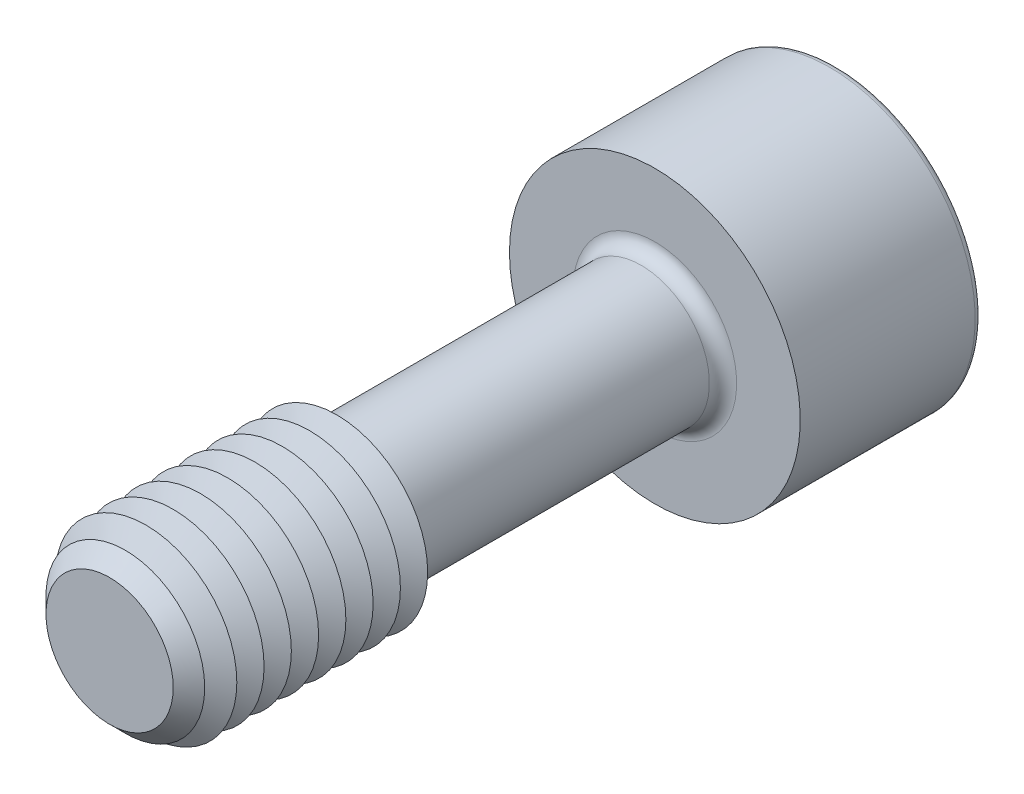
from build123d import *

# Parameters (mm, degrees)
SKETCH1_R       = 3.75
EXTRUDE1_DEPTH  = 15
CHAMFER1_SIZE   = 1.5
SKETCH3_R       = 8
EXTRUDE2_DEPTH  = 10
EXTRUDE3_DEPTH  = 8
FILLET1_R       = 0.75
FILLET2_R       = 0.375
LPATTERN1_COUNT = 8
LPATTERN1_PITCH = 1.5


with BuildPart() as part:
    # Sketch1 → Extrude1 (new, symmetric)
    with BuildSketch(Plane.XY):
        Circle(SKETCH1_R)
    extrude(amount=EXTRUDE1_DEPTH, both=True)

    # Sketch2 → Revolve1 (revolve)
    with BuildSketch(Plane(origin=(0, 0, 0), x_dir=(0, 0, -1), z_dir=(1, 0, 0))):
        Polygon((-15, 0), (-15, 5), (-2.5, 5), (-1.778312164, 3.75), (-1.778312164, 0), align=None)
    revolve(axis=Axis((0, 0, 1.778312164), (0, 0, 1)))

    # Chamfer1
    chamfer1_edges = [part.edges().sort_by_distance(p)[0] for p in [
        (0, -5, 15),
    ]]
    chamfer(chamfer1_edges, length=CHAMFER1_SIZE)

    # Sketch3 → Extrude2 (add)
    with BuildSketch(Plane(origin=(0, 0, -15), x_dir=(-1, 0, 0), z_dir=(0, 0, -1))):
        Circle(SKETCH3_R)
    extrude(amount=EXTRUDE2_DEPTH)

    # Sketch4 → Extrude3 (cut)
    with BuildSketch(Plane(origin=(-13.7, 0, -25), x_dir=(1, 0, 0), z_dir=(0, 0, 1))):
        Polygon((11.390598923, -4), (16.009401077, -4), (18.318802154, 0), (16.009401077, 4), (11.390598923, 4), (9.081197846, 0), align=None)
    extrude(amount=EXTRUDE3_DEPTH, mode=Mode.SUBTRACT)

    # Fillet1
    fillet1_edges = [part.edges().sort_by_distance(p)[0] for p in [
        (-3.75, 0, -15),
    ]]
    fillet(fillet1_edges, radius=FILLET1_R)

    # Fillet2
    fillet2_edges = [part.edges().sort_by_distance(p)[0] for p in [
        (8, 0, -25),
    ]]
    fillet(fillet2_edges, radius=FILLET2_R)

    # Sketch5 → Cut-Revolve1 (revolve, cut)
    with BuildSketch(Plane(origin=(0, 0, 0), x_dir=(0, 0, -1), z_dir=(1, 0, 0)), mode=Mode.PRIVATE) as cut_revolve1_sk:
        Polygon((17, 0), (17, -4), (14.690598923, 0), align=None)
    revolve(cut_revolve1_sk.sketch.rotate(Axis((0, 0, -14.690598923), (0, 0, -1)), 90), axis=Axis((0, 0, -14.690598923), (0, 0, -1)), mode=Mode.SUBTRACT)

    # Sketch7 → Cut-Revolve2 (revolve, cut)
    with BuildSketch(Plane(origin=(0, 0, 0), x_dir=(0, 0, -1), z_dir=(1, 0, 0)), mode=Mode.PRIVATE) as cut_revolve2_sk:
        Polygon((-2.5, 5), (-3.25, 3.700961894), (-4, 5), align=None)
    cut_revolve2 = revolve(cut_revolve2_sk.sketch.rotate(Axis((0, 0, -1.332048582), (0, 0, 1)), 90), axis=Axis((0, 0, -1.332048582), (0, 0, 1)), mode=Mode.SUBTRACT)

    # LPattern1: Cut-Revolve2 ×8
    with Locations(*[(0, 0, i * LPATTERN1_PITCH) for i in range(1, LPATTERN1_COUNT)]):
        add(cut_revolve2, mode=Mode.SUBTRACT)


solid = part.part
